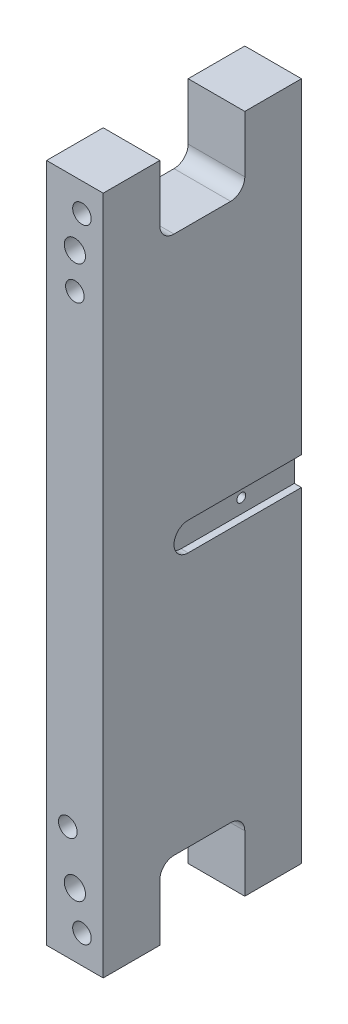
ISO-10303-21;
HEADER;
FILE_DESCRIPTION(('STEP AP214'),'2;1');
FILE_NAME('part.step','',(''),(''),'','','');
FILE_SCHEMA(('AUTOMOTIVE_DESIGN { 1 0 10303 214 1 1 1 1 }'));
ENDSEC;
DATA;
#1=APPLICATION_CONTEXT('core data for automotive mechanical design processes');
#2=APPLICATION_PROTOCOL_DEFINITION('international standard','automotive_design',2000,#1);
#3=PRODUCT_CONTEXT('',#1,'mechanical');
#4=PRODUCT('Part','Part','',(#3));
#5=PRODUCT_RELATED_PRODUCT_CATEGORY('part','',(#4));
#6=PRODUCT_DEFINITION_FORMATION('','',#4);
#7=PRODUCT_DEFINITION_CONTEXT('part definition',#1,'design');
#8=PRODUCT_DEFINITION('design','',#6,#7);
#9=PRODUCT_DEFINITION_SHAPE('','',#8);
#10=(LENGTH_UNIT() NAMED_UNIT(*) SI_UNIT(.MILLI.,.METRE.));
#11=(NAMED_UNIT(*) PLANE_ANGLE_UNIT() SI_UNIT($,.RADIAN.));
#12=(NAMED_UNIT(*) SI_UNIT($,.STERADIAN.) SOLID_ANGLE_UNIT());
#13=UNCERTAINTY_MEASURE_WITH_UNIT(LENGTH_MEASURE(1.E-05),#10,'distance_accuracy_value','');
#14=(GEOMETRIC_REPRESENTATION_CONTEXT(3) GLOBAL_UNCERTAINTY_ASSIGNED_CONTEXT((#13)) GLOBAL_UNIT_ASSIGNED_CONTEXT((#10,
#11,#12)) REPRESENTATION_CONTEXT('',''));
#15=CARTESIAN_POINT('',(0.,0.,0.));
#16=DIRECTION('',(0.,0.,1.));
#17=DIRECTION('',(1.,0.,0.));
#18=AXIS2_PLACEMENT_3D('',#15,#16,#17);
#19=CARTESIAN_POINT('',(160.643705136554,-304.8,0.));
#20=DIRECTION('',(0.,1.,0.));
#21=DIRECTION('',(-1.,0.,0.));
#22=AXIS2_PLACEMENT_3D('',#19,#20,#21);
#23=PLANE('',#22);
#24=DIRECTION('',(-1.,0.,0.));
#25=VECTOR('',#24,1.);
#26=CARTESIAN_POINT('',(160.643705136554,-304.8,0.));
#27=LINE('',#26,#25);
#28=CARTESIAN_POINT('',(0.,-304.8,0.));
#29=VERTEX_POINT('',#28);
#30=CARTESIAN_POINT('',(-50.8,-304.8,0.));
#31=VERTEX_POINT('',#30);
#32=EDGE_CURVE('E293',#29,#31,#27,.T.);
#33=ORIENTED_EDGE('',*,*,#32,.F.);
#34=DIRECTION('',(0.,0.,1.));
#35=VECTOR('',#34,1.);
#36=CARTESIAN_POINT('',(0.,-304.8,0.));
#37=LINE('',#36,#35);
#38=CARTESIAN_POINT('',(0.,-304.8,50.8));
#39=VERTEX_POINT('',#38);
#40=EDGE_CURVE('E280',#29,#39,#37,.T.);
#41=ORIENTED_EDGE('',*,*,#40,.T.);
#42=DIRECTION('',(-1.,0.,0.));
#43=VECTOR('',#42,1.);
#44=CARTESIAN_POINT('',(160.643705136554,-304.8,50.8));
#45=LINE('',#44,#43);
#46=CARTESIAN_POINT('',(-50.8,-304.8,50.8));
#47=VERTEX_POINT('',#46);
#48=EDGE_CURVE('E296',#39,#47,#45,.T.);
#49=ORIENTED_EDGE('',*,*,#48,.T.);
#50=DIRECTION('',(0.,0.,1.));
#51=VECTOR('',#50,1.);
#52=CARTESIAN_POINT('',(-50.8,-304.8,0.));
#53=LINE('',#52,#51);
#54=EDGE_CURVE('E404',#31,#47,#53,.T.);
#55=ORIENTED_EDGE('',*,*,#54,.F.);
#56=EDGE_LOOP('',(#33,#41,#49,#55));
#57=FACE_BOUND('',#56,.T.);
#58=ADVANCED_FACE('F56',(#57),#23,.F.);
#59=CARTESIAN_POINT('',(160.643705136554,-152.4,50.8));
#60=DIRECTION('',(0.,0.,-1.));
#61=DIRECTION('',(0.,1.,0.));
#62=AXIS2_PLACEMENT_3D('',#59,#60,#61);
#63=PLANE('',#62);
#64=DIRECTION('',(0.,1.,0.));
#65=VECTOR('',#64,1.);
#66=CARTESIAN_POINT('',(0.,-152.4,50.8));
#67=LINE('',#66,#65);
#68=CARTESIAN_POINT('',(0.,-254.,50.8));
#69=VERTEX_POINT('',#68);
#70=EDGE_CURVE('E283',#39,#69,#67,.T.);
#71=ORIENTED_EDGE('',*,*,#70,.T.);
#72=DIRECTION('',(-1.,0.,0.));
#73=VECTOR('',#72,1.);
#74=CARTESIAN_POINT('',(-50.8,-254.,50.8));
#75=LINE('',#74,#73);
#76=CARTESIAN_POINT('',(-50.8,-254.,50.8));
#77=VERTEX_POINT('',#76);
#78=EDGE_CURVE('E288',#69,#77,#75,.T.);
#79=ORIENTED_EDGE('',*,*,#78,.T.);
#80=DIRECTION('',(0.,1.,0.));
#81=VECTOR('',#80,1.);
#82=CARTESIAN_POINT('',(-50.8,-152.4,50.8));
#83=LINE('',#82,#81);
#84=EDGE_CURVE('E400',#47,#77,#83,.T.);
#85=ORIENTED_EDGE('',*,*,#84,.F.);
#86=ORIENTED_EDGE('',*,*,#48,.F.);
#87=EDGE_LOOP('',(#71,#79,#85,#86));
#88=FACE_BOUND('',#87,.T.);
#89=ADVANCED_FACE('F420',(#88),#63,.F.);
#90=CARTESIAN_POINT('',(160.643705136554,-152.4,0.));
#91=DIRECTION('',(0.,0.,1.));
#92=DIRECTION('',(0.,-1.,0.));
#93=AXIS2_PLACEMENT_3D('',#90,#91,#92);
#94=PLANE('',#93);
#95=DIRECTION('',(0.,1.,0.));
#96=VECTOR('',#95,1.);
#97=CARTESIAN_POINT('',(-6.34999999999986,-152.4,0.));
#98=LINE('',#97,#96);
#99=CARTESIAN_POINT('',(-6.35000000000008,-12.7,0.));
#100=VERTEX_POINT('',#99);
#101=CARTESIAN_POINT('',(-6.35000000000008,12.7,0.));
#102=VERTEX_POINT('',#101);
#103=EDGE_CURVE('E12',#100,#102,#98,.T.);
#104=ORIENTED_EDGE('',*,*,#103,.F.);
#105=DIRECTION('',(1.,0.,0.));
#106=VECTOR('',#105,1.);
#107=CARTESIAN_POINT('',(-6.35000000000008,-12.7,0.));
#108=LINE('',#107,#106);
#109=CARTESIAN_POINT('',(0.,-12.7,0.));
#110=VERTEX_POINT('',#109);
#111=EDGE_CURVE('E243',#100,#110,#108,.T.);
#112=ORIENTED_EDGE('',*,*,#111,.T.);
#113=DIRECTION('',(0.,-1.,0.));
#114=VECTOR('',#113,1.);
#115=CARTESIAN_POINT('',(0.,-152.4,0.));
#116=LINE('',#115,#114);
#117=EDGE_CURVE('E278',#110,#29,#116,.T.);
#118=ORIENTED_EDGE('',*,*,#117,.T.);
#119=ORIENTED_EDGE('',*,*,#32,.T.);
#120=DIRECTION('',(0.,-1.,0.));
#121=VECTOR('',#120,1.);
#122=CARTESIAN_POINT('',(-50.8,-152.4,0.));
#123=LINE('',#122,#121);
#124=CARTESIAN_POINT('',(-50.8,304.8,0.));
#125=VERTEX_POINT('',#124);
#126=EDGE_CURVE('E297',#125,#31,#123,.T.);
#127=ORIENTED_EDGE('',*,*,#126,.F.);
#128=DIRECTION('',(-1.,0.,0.));
#129=VECTOR('',#128,1.);
#130=CARTESIAN_POINT('',(160.643705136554,304.8,0.));
#131=LINE('',#130,#129);
#132=CARTESIAN_POINT('',(0.,304.8,0.));
#133=VERTEX_POINT('',#132);
#134=EDGE_CURVE('E473',#133,#125,#131,.T.);
#135=ORIENTED_EDGE('',*,*,#134,.F.);
#136=CARTESIAN_POINT('',(0.,12.7,0.));
#137=VERTEX_POINT('',#136);
#138=EDGE_CURVE('E225',#133,#137,#116,.T.);
#139=ORIENTED_EDGE('',*,*,#138,.T.);
#140=DIRECTION('',(1.,0.,0.));
#141=VECTOR('',#140,1.);
#142=CARTESIAN_POINT('',(-6.35000000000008,12.7,0.));
#143=LINE('',#142,#141);
#144=EDGE_CURVE('E72',#102,#137,#143,.T.);
#145=ORIENTED_EDGE('',*,*,#144,.F.);
#146=EDGE_LOOP('',(#104,#112,#118,#119,#127,#135,#139,#145));
#147=FACE_BOUND('',#146,.T.);
#148=ADVANCED_FACE('F223',(#147),#94,.F.);
#149=CARTESIAN_POINT('',(0.,304.8,177.8));
#150=DIRECTION('',(-1.,0.,0.));
#151=DIRECTION('',(0.,-1.,0.));
#152=AXIS2_PLACEMENT_3D('',#149,#150,#151);
#153=PLANE('',#152);
#154=ORIENTED_EDGE('',*,*,#117,.F.);
#155=DIRECTION('',(0.,0.,-1.));
#156=VECTOR('',#155,1.);
#157=CARTESIAN_POINT('',(0.,-12.7,0.));
#158=LINE('',#157,#156);
#159=CARTESIAN_POINT('',(0.,-12.7,101.6));
#160=VERTEX_POINT('',#159);
#161=EDGE_CURVE('E220',#160,#110,#158,.T.);
#162=ORIENTED_EDGE('',*,*,#161,.F.);
#163=CARTESIAN_POINT('',(0.,0.,101.6));
#164=DIRECTION('',(1.,0.,0.));
#165=DIRECTION('',(0.,1.,0.));
#166=AXIS2_PLACEMENT_3D('',#163,#164,#165);
#167=CIRCLE('',#166,12.7);
#168=CARTESIAN_POINT('',(0.,12.7,101.6));
#169=VERTEX_POINT('',#168);
#170=EDGE_CURVE('E255',#169,#160,#167,.T.);
#171=ORIENTED_EDGE('',*,*,#170,.F.);
#172=DIRECTION('',(0.,0.,1.));
#173=VECTOR('',#172,1.);
#174=CARTESIAN_POINT('',(0.,12.7,0.));
#175=LINE('',#174,#173);
#176=EDGE_CURVE('E261',#137,#169,#175,.T.);
#177=ORIENTED_EDGE('',*,*,#176,.F.);
#178=ORIENTED_EDGE('',*,*,#138,.F.);
#179=DIRECTION('',(0.,0.,1.));
#180=VECTOR('',#179,1.);
#181=CARTESIAN_POINT('',(0.,304.8,0.));
#182=LINE('',#181,#180);
#183=CARTESIAN_POINT('',(0.,304.8,50.8));
#184=VERTEX_POINT('',#183);
#185=EDGE_CURVE('E479',#133,#184,#182,.T.);
#186=ORIENTED_EDGE('',*,*,#185,.T.);
#187=DIRECTION('',(0.,-1.,0.));
#188=VECTOR('',#187,1.);
#189=CARTESIAN_POINT('',(0.,152.4,50.8));
#190=LINE('',#189,#188);
#191=CARTESIAN_POINT('',(0.,254.,50.8));
#192=VERTEX_POINT('',#191);
#193=EDGE_CURVE('E474',#184,#192,#190,.T.);
#194=ORIENTED_EDGE('',*,*,#193,.T.);
#195=CARTESIAN_POINT('',(0.,254.,63.5));
#196=DIRECTION('',(-1.,0.,0.));
#197=DIRECTION('',(0.,-1.,0.));
#198=AXIS2_PLACEMENT_3D('',#195,#196,#197);
#199=CIRCLE('',#198,12.7);
#200=CARTESIAN_POINT('',(4.44089209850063E-13,241.3,63.5));
#201=VERTEX_POINT('',#200);
#202=EDGE_CURVE('E65',#192,#201,#199,.T.);
#203=ORIENTED_EDGE('',*,*,#202,.T.);
#204=DIRECTION('',(0.,0.,-1.));
#205=VECTOR('',#204,1.);
#206=CARTESIAN_POINT('',(4.44089209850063E-13,241.3,50.8));
#207=LINE('',#206,#205);
#208=CARTESIAN_POINT('',(4.44089209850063E-13,241.3,114.3));
#209=VERTEX_POINT('',#208);
#210=EDGE_CURVE('E489',#209,#201,#207,.T.);
#211=ORIENTED_EDGE('',*,*,#210,.F.);
#212=CARTESIAN_POINT('',(4.44089209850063E-13,254.,114.3));
#213=DIRECTION('',(1.,0.,0.));
#214=DIRECTION('',(0.,-1.,0.));
#215=AXIS2_PLACEMENT_3D('',#212,#213,#214);
#216=CIRCLE('',#215,12.7);
#217=CARTESIAN_POINT('',(4.44089209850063E-13,254.,127.));
#218=VERTEX_POINT('',#217);
#219=EDGE_CURVE('E491',#218,#209,#216,.T.);
#220=ORIENTED_EDGE('',*,*,#219,.F.);
#221=DIRECTION('',(0.,-1.,0.));
#222=VECTOR('',#221,1.);
#223=CARTESIAN_POINT('',(4.44089209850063E-13,304.8,127.));
#224=LINE('',#223,#222);
#225=CARTESIAN_POINT('',(4.44089209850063E-13,304.8,127.));
#226=VERTEX_POINT('',#225);
#227=EDGE_CURVE('E338',#226,#218,#224,.T.);
#228=ORIENTED_EDGE('',*,*,#227,.F.);
#229=DIRECTION('',(0.,0.,-1.));
#230=VECTOR('',#229,1.);
#231=CARTESIAN_POINT('',(0.,304.8,177.8));
#232=LINE('',#231,#230);
#233=CARTESIAN_POINT('',(0.,304.8,177.8));
#234=VERTEX_POINT('',#233);
#235=EDGE_CURVE('E396',#234,#226,#232,.T.);
#236=ORIENTED_EDGE('',*,*,#235,.F.);
#237=DIRECTION('',(0.,1.,0.));
#238=VECTOR('',#237,1.);
#239=CARTESIAN_POINT('',(0.,304.8,177.8));
#240=LINE('',#239,#238);
#241=CARTESIAN_POINT('',(0.,-304.8,177.8));
#242=VERTEX_POINT('',#241);
#243=EDGE_CURVE('E371',#242,#234,#240,.T.);
#244=ORIENTED_EDGE('',*,*,#243,.F.);
#245=DIRECTION('',(0.,0.,-1.));
#246=VECTOR('',#245,1.);
#247=CARTESIAN_POINT('',(0.,-304.8,177.8));
#248=LINE('',#247,#246);
#249=CARTESIAN_POINT('',(2.22044604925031E-13,-304.8,127.));
#250=VERTEX_POINT('',#249);
#251=EDGE_CURVE('E384',#242,#250,#248,.T.);
#252=ORIENTED_EDGE('',*,*,#251,.T.);
#253=DIRECTION('',(0.,1.,0.));
#254=VECTOR('',#253,1.);
#255=CARTESIAN_POINT('',(2.22044604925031E-13,-304.8,127.));
#256=LINE('',#255,#254);
#257=CARTESIAN_POINT('',(2.22044604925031E-13,-254.,127.));
#258=VERTEX_POINT('',#257);
#259=EDGE_CURVE('E341',#250,#258,#256,.T.);
#260=ORIENTED_EDGE('',*,*,#259,.T.);
#261=CARTESIAN_POINT('',(2.22044604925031E-13,-254.,114.3));
#262=DIRECTION('',(-1.,0.,0.));
#263=DIRECTION('',(0.,1.,0.));
#264=AXIS2_PLACEMENT_3D('',#261,#262,#263);
#265=CIRCLE('',#264,12.7);
#266=CARTESIAN_POINT('',(2.22044604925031E-13,-241.3,114.3));
#267=VERTEX_POINT('',#266);
#268=EDGE_CURVE('E345',#258,#267,#265,.T.);
#269=ORIENTED_EDGE('',*,*,#268,.T.);
#270=DIRECTION('',(0.,0.,-1.));
#271=VECTOR('',#270,1.);
#272=CARTESIAN_POINT('',(2.22044604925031E-13,-241.3,50.8));
#273=LINE('',#272,#271);
#274=CARTESIAN_POINT('',(2.22044604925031E-13,-241.3,63.5));
#275=VERTEX_POINT('',#274);
#276=EDGE_CURVE('E351',#267,#275,#273,.T.);
#277=ORIENTED_EDGE('',*,*,#276,.T.);
#278=CARTESIAN_POINT('',(0.,-254.,63.5));
#279=DIRECTION('',(-1.,0.,0.));
#280=DIRECTION('',(0.,-1.,0.));
#281=AXIS2_PLACEMENT_3D('',#278,#279,#280);
#282=CIRCLE('',#281,12.7);
#283=EDGE_CURVE('E321',#275,#69,#282,.T.);
#284=ORIENTED_EDGE('',*,*,#283,.T.);
#285=ORIENTED_EDGE('',*,*,#70,.F.);
#286=ORIENTED_EDGE('',*,*,#40,.F.);
#287=EDGE_LOOP('',(#154,#162,#171,#177,#178,#186,#194,#203,#211,#220,#228,#236,#244,#252,#260,
#269,#277,#284,#285,#286));
#288=FACE_BOUND('',#287,.T.);
#289=ADVANCED_FACE('F276',(#288),#153,.F.);
#290=CARTESIAN_POINT('',(-50.8,304.8,177.8));
#291=DIRECTION('',(1.,0.,0.));
#292=DIRECTION('',(0.,1.,0.));
#293=AXIS2_PLACEMENT_3D('',#290,#291,#292);
#294=PLANE('',#293);
#295=CARTESIAN_POINT('',(-50.8,0.,47.625));
#296=DIRECTION('',(1.,0.,0.));
#297=DIRECTION('',(0.,0.,-1.));
#298=AXIS2_PLACEMENT_3D('',#295,#296,#297);
#299=CIRCLE('',#298,3.96874999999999);
#300=CARTESIAN_POINT('',(-50.8,0.,43.65625));
#301=VERTEX_POINT('',#300);
#302=EDGE_CURVE('E633',#301,#301,#299,.T.);
#303=ORIENTED_EDGE('',*,*,#302,.T.);
#304=EDGE_LOOP('',(#303));
#305=FACE_BOUND('',#304,.T.);
#306=ORIENTED_EDGE('',*,*,#84,.T.);
#307=CARTESIAN_POINT('',(-50.8,-254.,63.5));
#308=DIRECTION('',(1.,0.,0.));
#309=DIRECTION('',(0.,1.,0.));
#310=AXIS2_PLACEMENT_3D('',#307,#308,#309);
#311=CIRCLE('',#310,12.7);
#312=CARTESIAN_POINT('',(-50.8,-241.3,63.5));
#313=VERTEX_POINT('',#312);
#314=EDGE_CURVE('E324',#77,#313,#311,.T.);
#315=ORIENTED_EDGE('',*,*,#314,.T.);
#316=DIRECTION('',(0.,0.,-1.));
#317=VECTOR('',#316,1.);
#318=CARTESIAN_POINT('',(-50.8,-241.3,50.8));
#319=LINE('',#318,#317);
#320=CARTESIAN_POINT('',(-50.8,-241.3,114.3));
#321=VERTEX_POINT('',#320);
#322=EDGE_CURVE('E346',#321,#313,#319,.T.);
#323=ORIENTED_EDGE('',*,*,#322,.F.);
#324=CARTESIAN_POINT('',(-50.8,-254.,114.3));
#325=DIRECTION('',(-1.,0.,0.));
#326=DIRECTION('',(0.,1.,0.));
#327=AXIS2_PLACEMENT_3D('',#324,#325,#326);
#328=CIRCLE('',#327,12.7);
#329=CARTESIAN_POINT('',(-50.8,-254.,127.));
#330=VERTEX_POINT('',#329);
#331=EDGE_CURVE('E435',#330,#321,#328,.T.);
#332=ORIENTED_EDGE('',*,*,#331,.F.);
#333=DIRECTION('',(0.,1.,0.));
#334=VECTOR('',#333,1.);
#335=CARTESIAN_POINT('',(-50.8,-304.8,127.));
#336=LINE('',#335,#334);
#337=CARTESIAN_POINT('',(-50.8,-304.8,127.));
#338=VERTEX_POINT('',#337);
#339=EDGE_CURVE('E509',#338,#330,#336,.T.);
#340=ORIENTED_EDGE('',*,*,#339,.F.);
#341=DIRECTION('',(0.,0.,-1.));
#342=VECTOR('',#341,1.);
#343=CARTESIAN_POINT('',(-50.8,-304.8,177.8));
#344=LINE('',#343,#342);
#345=CARTESIAN_POINT('',(-50.8,-304.8,177.8));
#346=VERTEX_POINT('',#345);
#347=EDGE_CURVE('E388',#346,#338,#344,.T.);
#348=ORIENTED_EDGE('',*,*,#347,.F.);
#349=DIRECTION('',(0.,-1.,0.));
#350=VECTOR('',#349,1.);
#351=CARTESIAN_POINT('',(-50.8,304.8,177.8));
#352=LINE('',#351,#350);
#353=CARTESIAN_POINT('',(-50.8,304.8,177.8));
#354=VERTEX_POINT('',#353);
#355=EDGE_CURVE('E378',#354,#346,#352,.T.);
#356=ORIENTED_EDGE('',*,*,#355,.F.);
#357=DIRECTION('',(0.,0.,-1.));
#358=VECTOR('',#357,1.);
#359=CARTESIAN_POINT('',(-50.8,304.8,177.8));
#360=LINE('',#359,#358);
#361=CARTESIAN_POINT('',(-50.8,304.8,127.));
#362=VERTEX_POINT('',#361);
#363=EDGE_CURVE('E392',#354,#362,#360,.T.);
#364=ORIENTED_EDGE('',*,*,#363,.T.);
#365=DIRECTION('',(0.,-1.,0.));
#366=VECTOR('',#365,1.);
#367=CARTESIAN_POINT('',(-50.8,304.8,127.));
#368=LINE('',#367,#366);
#369=CARTESIAN_POINT('',(-50.8,254.,127.));
#370=VERTEX_POINT('',#369);
#371=EDGE_CURVE('E492',#362,#370,#368,.T.);
#372=ORIENTED_EDGE('',*,*,#371,.T.);
#373=CARTESIAN_POINT('',(-50.8,254.,114.3));
#374=DIRECTION('',(1.,0.,0.));
#375=DIRECTION('',(0.,-1.,0.));
#376=AXIS2_PLACEMENT_3D('',#373,#374,#375);
#377=CIRCLE('',#376,12.7);
#378=CARTESIAN_POINT('',(-50.8,241.3,114.3));
#379=VERTEX_POINT('',#378);
#380=EDGE_CURVE('E499',#370,#379,#377,.T.);
#381=ORIENTED_EDGE('',*,*,#380,.T.);
#382=DIRECTION('',(0.,0.,-1.));
#383=VECTOR('',#382,1.);
#384=CARTESIAN_POINT('',(-50.8,241.3,50.8));
#385=LINE('',#384,#383);
#386=CARTESIAN_POINT('',(-50.8,241.3,63.5));
#387=VERTEX_POINT('',#386);
#388=EDGE_CURVE('E478',#379,#387,#385,.T.);
#389=ORIENTED_EDGE('',*,*,#388,.T.);
#390=CARTESIAN_POINT('',(-50.8,254.,63.5));
#391=DIRECTION('',(1.,0.,0.));
#392=DIRECTION('',(0.,1.,0.));
#393=AXIS2_PLACEMENT_3D('',#390,#391,#392);
#394=CIRCLE('',#393,12.7);
#395=CARTESIAN_POINT('',(-50.8,254.,50.8));
#396=VERTEX_POINT('',#395);
#397=EDGE_CURVE('E80',#387,#396,#394,.T.);
#398=ORIENTED_EDGE('',*,*,#397,.T.);
#399=DIRECTION('',(0.,-1.,0.));
#400=VECTOR('',#399,1.);
#401=CARTESIAN_POINT('',(-50.8,152.4,50.8));
#402=LINE('',#401,#400);
#403=CARTESIAN_POINT('',(-50.8,304.8,50.8));
#404=VERTEX_POINT('',#403);
#405=EDGE_CURVE('E468',#404,#396,#402,.T.);
#406=ORIENTED_EDGE('',*,*,#405,.F.);
#407=DIRECTION('',(0.,0.,1.));
#408=VECTOR('',#407,1.);
#409=CARTESIAN_POINT('',(-50.8,304.8,0.));
#410=LINE('',#409,#408);
#411=EDGE_CURVE('E415',#125,#404,#410,.T.);
#412=ORIENTED_EDGE('',*,*,#411,.F.);
#413=ORIENTED_EDGE('',*,*,#126,.T.);
#414=ORIENTED_EDGE('',*,*,#54,.T.);
#415=EDGE_LOOP('',(#306,#315,#323,#332,#340,#348,#356,#364,#372,#381,#389,#398,#406,#412,#413,#414));
#416=FACE_BOUND('',#415,.T.);
#417=ADVANCED_FACE('F412',(#305,#416),#294,.F.);
#418=CARTESIAN_POINT('',(0.,304.8,177.8));
#419=DIRECTION('',(0.,-1.,0.));
#420=DIRECTION('',(0.,0.,-1.));
#421=AXIS2_PLACEMENT_3D('',#418,#419,#420);
#422=PLANE('',#421);
#423=DIRECTION('',(-1.,0.,0.));
#424=VECTOR('',#423,1.);
#425=CARTESIAN_POINT('',(4.44089209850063E-13,304.8,127.));
#426=LINE('',#425,#424);
#427=EDGE_CURVE('E506',#226,#362,#426,.T.);
#428=ORIENTED_EDGE('',*,*,#427,.T.);
#429=ORIENTED_EDGE('',*,*,#363,.F.);
#430=DIRECTION('',(-1.,0.,0.));
#431=VECTOR('',#430,1.);
#432=CARTESIAN_POINT('',(0.,304.8,177.8));
#433=LINE('',#432,#431);
#434=EDGE_CURVE('E375',#234,#354,#433,.T.);
#435=ORIENTED_EDGE('',*,*,#434,.F.);
#436=ORIENTED_EDGE('',*,*,#235,.T.);
#437=EDGE_LOOP('',(#428,#429,#435,#436));
#438=FACE_BOUND('',#437,.T.);
#439=ADVANCED_FACE('F528',(#438),#422,.F.);
#440=CARTESIAN_POINT('',(0.,-304.8,177.8));
#441=DIRECTION('',(0.,1.,0.));
#442=DIRECTION('',(0.,0.,1.));
#443=AXIS2_PLACEMENT_3D('',#440,#441,#442);
#444=PLANE('',#443);
#445=ORIENTED_EDGE('',*,*,#347,.T.);
#446=DIRECTION('',(-1.,0.,0.));
#447=VECTOR('',#446,1.);
#448=CARTESIAN_POINT('',(2.22044604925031E-13,-304.8,127.));
#449=LINE('',#448,#447);
#450=EDGE_CURVE('E366',#250,#338,#449,.T.);
#451=ORIENTED_EDGE('',*,*,#450,.F.);
#452=ORIENTED_EDGE('',*,*,#251,.F.);
#453=DIRECTION('',(1.,0.,0.));
#454=VECTOR('',#453,1.);
#455=CARTESIAN_POINT('',(0.,-304.8,177.8));
#456=LINE('',#455,#454);
#457=EDGE_CURVE('E381',#346,#242,#456,.T.);
#458=ORIENTED_EDGE('',*,*,#457,.F.);
#459=EDGE_LOOP('',(#445,#451,#452,#458));
#460=FACE_BOUND('',#459,.T.);
#461=ADVANCED_FACE('F661',(#460),#444,.F.);
#462=CARTESIAN_POINT('',(0.,0.,177.8));
#463=DIRECTION('',(0.,0.,-1.));
#464=DIRECTION('',(-1.,0.,0.));
#465=AXIS2_PLACEMENT_3D('',#462,#463,#464);
#466=PLANE('',#465);
#467=CARTESIAN_POINT('',(-25.3999999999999,247.65,177.8));
#468=DIRECTION('',(0.,0.,1.));
#469=DIRECTION('',(1.,0.,0.));
#470=AXIS2_PLACEMENT_3D('',#467,#468,#469);
#471=CIRCLE('',#470,9.525);
#472=CARTESIAN_POINT('',(-15.8749999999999,247.65,177.8));
#473=VERTEX_POINT('',#472);
#474=EDGE_CURVE('E242',#473,#473,#471,.T.);
#475=ORIENTED_EDGE('',*,*,#474,.F.);
#476=EDGE_LOOP('',(#475));
#477=FACE_BOUND('',#476,.T.);
#478=CARTESIAN_POINT('',(-25.4000000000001,-247.65,177.8));
#479=DIRECTION('',(0.,0.,1.));
#480=DIRECTION('',(1.,0.,0.));
#481=AXIS2_PLACEMENT_3D('',#478,#479,#480);
#482=CIRCLE('',#481,9.525);
#483=CARTESIAN_POINT('',(-15.8750000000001,-247.65,177.8));
#484=VERTEX_POINT('',#483);
#485=EDGE_CURVE('E724',#484,#484,#482,.T.);
#486=ORIENTED_EDGE('',*,*,#485,.F.);
#487=EDGE_LOOP('',(#486));
#488=FACE_BOUND('',#487,.T.);
#489=CARTESIAN_POINT('',(-19.05,-279.4,177.8));
#490=DIRECTION('',(0.,0.,1.));
#491=DIRECTION('',(1.,0.,0.));
#492=AXIS2_PLACEMENT_3D('',#489,#490,#491);
#493=CIRCLE('',#492,8.33374);
#494=CARTESIAN_POINT('',(-10.71626,-279.4,177.8));
#495=VERTEX_POINT('',#494);
#496=EDGE_CURVE('E717',#495,#495,#493,.T.);
#497=ORIENTED_EDGE('',*,*,#496,.F.);
#498=EDGE_LOOP('',(#497));
#499=FACE_BOUND('',#498,.T.);
#500=CARTESIAN_POINT('',(-31.7499999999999,-203.2,177.8));
#501=DIRECTION('',(0.,0.,1.));
#502=DIRECTION('',(1.,0.,0.));
#503=AXIS2_PLACEMENT_3D('',#500,#501,#502);
#504=CIRCLE('',#503,8.33374);
#505=CARTESIAN_POINT('',(-23.4162599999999,-203.2,177.8));
#506=VERTEX_POINT('',#505);
#507=EDGE_CURVE('E693',#506,#506,#504,.T.);
#508=ORIENTED_EDGE('',*,*,#507,.F.);
#509=EDGE_LOOP('',(#508));
#510=FACE_BOUND('',#509,.T.);
#511=CARTESIAN_POINT('',(-19.05,279.4,177.8));
#512=DIRECTION('',(0.,0.,1.));
#513=DIRECTION('',(1.,0.,0.));
#514=AXIS2_PLACEMENT_3D('',#511,#512,#513);
#515=CIRCLE('',#514,8.33374);
#516=CARTESIAN_POINT('',(-10.71626,279.4,177.8));
#517=VERTEX_POINT('',#516);
#518=EDGE_CURVE('E689',#517,#517,#515,.T.);
#519=ORIENTED_EDGE('',*,*,#518,.F.);
#520=EDGE_LOOP('',(#519));
#521=FACE_BOUND('',#520,.T.);
#522=CARTESIAN_POINT('',(-25.4000000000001,215.9,177.8));
#523=DIRECTION('',(0.,0.,1.));
#524=DIRECTION('',(1.,0.,0.));
#525=AXIS2_PLACEMENT_3D('',#522,#523,#524);
#526=CIRCLE('',#525,8.33374);
#527=CARTESIAN_POINT('',(-17.0662600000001,215.9,177.8));
#528=VERTEX_POINT('',#527);
#529=EDGE_CURVE('E460',#528,#528,#526,.T.);
#530=ORIENTED_EDGE('',*,*,#529,.F.);
#531=EDGE_LOOP('',(#530));
#532=FACE_BOUND('',#531,.T.);
#533=ORIENTED_EDGE('',*,*,#243,.T.);
#534=ORIENTED_EDGE('',*,*,#434,.T.);
#535=ORIENTED_EDGE('',*,*,#355,.T.);
#536=ORIENTED_EDGE('',*,*,#457,.T.);
#537=EDGE_LOOP('',(#533,#534,#535,#536));
#538=FACE_BOUND('',#537,.T.);
#539=ADVANCED_FACE('F532',(#477,#488,#499,#510,#521,#532,#538),#466,.F.);
#540=CARTESIAN_POINT('',(2.22044604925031E-13,-241.3,50.8));
#541=DIRECTION('',(0.,1.,0.));
#542=DIRECTION('',(-1.,0.,0.));
#543=AXIS2_PLACEMENT_3D('',#540,#541,#542);
#544=PLANE('',#543);
#545=ORIENTED_EDGE('',*,*,#322,.T.);
#546=DIRECTION('',(-1.,0.,0.));
#547=VECTOR('',#546,1.);
#548=CARTESIAN_POINT('',(2.22044604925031E-13,-241.3,63.5));
#549=LINE('',#548,#547);
#550=EDGE_CURVE('E306',#313,#275,#549,.F.);
#551=ORIENTED_EDGE('',*,*,#550,.T.);
#552=ORIENTED_EDGE('',*,*,#276,.F.);
#553=DIRECTION('',(-1.,0.,0.));
#554=VECTOR('',#553,1.);
#555=CARTESIAN_POINT('',(2.22044604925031E-13,-241.3,114.3));
#556=LINE('',#555,#554);
#557=EDGE_CURVE('E365',#267,#321,#556,.T.);
#558=ORIENTED_EDGE('',*,*,#557,.T.);
#559=EDGE_LOOP('',(#545,#551,#552,#558));
#560=FACE_BOUND('',#559,.T.);
#561=ADVANCED_FACE('F430',(#560),#544,.F.);
#562=CARTESIAN_POINT('',(2.22044604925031E-13,-254.,114.3));
#563=DIRECTION('',(-1.,0.,0.));
#564=DIRECTION('',(0.,-1.,0.));
#565=AXIS2_PLACEMENT_3D('',#562,#563,#564);
#566=CYLINDRICAL_SURFACE('',#565,12.7);
#567=ORIENTED_EDGE('',*,*,#331,.T.);
#568=ORIENTED_EDGE('',*,*,#557,.F.);
#569=ORIENTED_EDGE('',*,*,#268,.F.);
#570=DIRECTION('',(-1.,0.,0.));
#571=VECTOR('',#570,1.);
#572=CARTESIAN_POINT('',(2.22044604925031E-13,-254.,127.));
#573=LINE('',#572,#571);
#574=EDGE_CURVE('E361',#258,#330,#573,.T.);
#575=ORIENTED_EDGE('',*,*,#574,.T.);
#576=EDGE_LOOP('',(#567,#568,#569,#575));
#577=FACE_BOUND('',#576,.T.);
#578=ADVANCED_FACE('F673',(#577),#566,.F.);
#579=CARTESIAN_POINT('',(2.22044604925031E-13,-304.8,127.));
#580=DIRECTION('',(0.,0.,1.));
#581=DIRECTION('',(1.,0.,0.));
#582=AXIS2_PLACEMENT_3D('',#579,#580,#581);
#583=PLANE('',#582);
#584=CARTESIAN_POINT('',(-19.05,-279.4,127.));
#585=DIRECTION('',(0.,0.,1.));
#586=DIRECTION('',(1.,0.,0.));
#587=AXIS2_PLACEMENT_3D('',#584,#585,#586);
#588=CIRCLE('',#587,8.33374);
#589=CARTESIAN_POINT('',(-10.71626,-279.4,127.));
#590=VERTEX_POINT('',#589);
#591=EDGE_CURVE('E712',#590,#590,#588,.T.);
#592=ORIENTED_EDGE('',*,*,#591,.T.);
#593=EDGE_LOOP('',(#592));
#594=FACE_BOUND('',#593,.T.);
#595=ORIENTED_EDGE('',*,*,#339,.T.);
#596=ORIENTED_EDGE('',*,*,#574,.F.);
#597=ORIENTED_EDGE('',*,*,#259,.F.);
#598=ORIENTED_EDGE('',*,*,#450,.T.);
#599=EDGE_LOOP('',(#595,#596,#597,#598));
#600=FACE_BOUND('',#599,.T.);
#601=ADVANCED_FACE('F670',(#594,#600),#583,.F.);
#602=CARTESIAN_POINT('',(4.44089209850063E-13,304.8,127.));
#603=DIRECTION('',(0.,0.,-1.));
#604=DIRECTION('',(-1.,0.,0.));
#605=AXIS2_PLACEMENT_3D('',#602,#603,#604);
#606=PLANE('',#605);
#607=CARTESIAN_POINT('',(-19.05,279.4,127.));
#608=DIRECTION('',(0.,0.,-1.));
#609=DIRECTION('',(-1.,0.,0.));
#610=AXIS2_PLACEMENT_3D('',#607,#608,#609);
#611=CIRCLE('',#610,8.33374);
#612=CARTESIAN_POINT('',(-27.38374,279.4,127.));
#613=VERTEX_POINT('',#612);
#614=EDGE_CURVE('E461',#613,#613,#611,.T.);
#615=ORIENTED_EDGE('',*,*,#614,.F.);
#616=EDGE_LOOP('',(#615));
#617=FACE_BOUND('',#616,.T.);
#618=ORIENTED_EDGE('',*,*,#371,.F.);
#619=ORIENTED_EDGE('',*,*,#427,.F.);
#620=ORIENTED_EDGE('',*,*,#227,.T.);
#621=DIRECTION('',(-1.,0.,0.));
#622=VECTOR('',#621,1.);
#623=CARTESIAN_POINT('',(4.44089209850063E-13,254.,127.));
#624=LINE('',#623,#622);
#625=EDGE_CURVE('E337',#218,#370,#624,.T.);
#626=ORIENTED_EDGE('',*,*,#625,.T.);
#627=EDGE_LOOP('',(#618,#619,#620,#626));
#628=FACE_BOUND('',#627,.T.);
#629=ADVANCED_FACE('F520',(#617,#628),#606,.T.);
#630=CARTESIAN_POINT('',(4.44089209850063E-13,254.,114.3));
#631=DIRECTION('',(-1.,0.,0.));
#632=DIRECTION('',(0.,-1.,0.));
#633=AXIS2_PLACEMENT_3D('',#630,#631,#632);
#634=CYLINDRICAL_SURFACE('',#633,12.7);
#635=ORIENTED_EDGE('',*,*,#380,.F.);
#636=ORIENTED_EDGE('',*,*,#625,.F.);
#637=ORIENTED_EDGE('',*,*,#219,.T.);
#638=DIRECTION('',(-1.,0.,0.));
#639=VECTOR('',#638,1.);
#640=CARTESIAN_POINT('',(4.44089209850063E-13,241.3,114.3));
#641=LINE('',#640,#639);
#642=EDGE_CURVE('E332',#209,#379,#641,.T.);
#643=ORIENTED_EDGE('',*,*,#642,.T.);
#644=EDGE_LOOP('',(#635,#636,#637,#643));
#645=FACE_BOUND('',#644,.T.);
#646=ADVANCED_FACE('F524',(#645),#634,.F.);
#647=CARTESIAN_POINT('',(4.44089209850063E-13,241.3,50.8));
#648=DIRECTION('',(0.,1.,0.));
#649=DIRECTION('',(-1.,0.,0.));
#650=AXIS2_PLACEMENT_3D('',#647,#648,#649);
#651=PLANE('',#650);
#652=ORIENTED_EDGE('',*,*,#210,.T.);
#653=DIRECTION('',(-1.,0.,0.));
#654=VECTOR('',#653,1.);
#655=CARTESIAN_POINT('',(4.44089209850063E-13,241.3,63.5));
#656=LINE('',#655,#654);
#657=EDGE_CURVE('E439',#201,#387,#656,.T.);
#658=ORIENTED_EDGE('',*,*,#657,.T.);
#659=ORIENTED_EDGE('',*,*,#388,.F.);
#660=ORIENTED_EDGE('',*,*,#642,.F.);
#661=EDGE_LOOP('',(#652,#658,#659,#660));
#662=FACE_BOUND('',#661,.T.);
#663=ADVANCED_FACE('F536',(#662),#651,.T.);
#664=CARTESIAN_POINT('',(160.643705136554,304.8,0.));
#665=DIRECTION('',(0.,-1.,0.));
#666=DIRECTION('',(-1.,0.,0.));
#667=AXIS2_PLACEMENT_3D('',#664,#665,#666);
#668=PLANE('',#667);
#669=ORIENTED_EDGE('',*,*,#134,.T.);
#670=ORIENTED_EDGE('',*,*,#411,.T.);
#671=DIRECTION('',(-1.,0.,0.));
#672=VECTOR('',#671,1.);
#673=CARTESIAN_POINT('',(160.643705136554,304.8,50.8));
#674=LINE('',#673,#672);
#675=EDGE_CURVE('E482',#184,#404,#674,.T.);
#676=ORIENTED_EDGE('',*,*,#675,.F.);
#677=ORIENTED_EDGE('',*,*,#185,.F.);
#678=EDGE_LOOP('',(#669,#670,#676,#677));
#679=FACE_BOUND('',#678,.T.);
#680=ADVANCED_FACE('F545',(#679),#668,.F.);
#681=CARTESIAN_POINT('',(160.643705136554,152.4,50.8));
#682=DIRECTION('',(0.,0.,-1.));
#683=DIRECTION('',(0.,-1.,0.));
#684=AXIS2_PLACEMENT_3D('',#681,#682,#683);
#685=PLANE('',#684);
#686=ORIENTED_EDGE('',*,*,#405,.T.);
#687=DIRECTION('',(-1.,0.,0.));
#688=VECTOR('',#687,1.);
#689=CARTESIAN_POINT('',(160.643705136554,254.,50.8));
#690=LINE('',#689,#688);
#691=EDGE_CURVE('E428',#396,#192,#690,.F.);
#692=ORIENTED_EDGE('',*,*,#691,.T.);
#693=ORIENTED_EDGE('',*,*,#193,.F.);
#694=ORIENTED_EDGE('',*,*,#675,.T.);
#695=EDGE_LOOP('',(#686,#692,#693,#694));
#696=FACE_BOUND('',#695,.T.);
#697=ADVANCED_FACE('F541',(#696),#685,.F.);
#698=CARTESIAN_POINT('',(160.643705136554,-254.,63.5));
#699=DIRECTION('',(1.,0.,0.));
#700=DIRECTION('',(0.,1.,0.));
#701=AXIS2_PLACEMENT_3D('',#698,#699,#700);
#702=CYLINDRICAL_SURFACE('',#701,12.7);
#703=ORIENTED_EDGE('',*,*,#283,.F.);
#704=ORIENTED_EDGE('',*,*,#550,.F.);
#705=ORIENTED_EDGE('',*,*,#314,.F.);
#706=ORIENTED_EDGE('',*,*,#78,.F.);
#707=EDGE_LOOP('',(#703,#704,#705,#706));
#708=FACE_BOUND('',#707,.T.);
#709=ADVANCED_FACE('F437',(#708),#702,.F.);
#710=CARTESIAN_POINT('',(4.44089209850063E-13,254.,63.5));
#711=DIRECTION('',(-1.,0.,0.));
#712=DIRECTION('',(0.,-1.,0.));
#713=AXIS2_PLACEMENT_3D('',#710,#711,#712);
#714=CYLINDRICAL_SURFACE('',#713,12.7);
#715=ORIENTED_EDGE('',*,*,#202,.F.);
#716=ORIENTED_EDGE('',*,*,#691,.F.);
#717=ORIENTED_EDGE('',*,*,#397,.F.);
#718=ORIENTED_EDGE('',*,*,#657,.F.);
#719=EDGE_LOOP('',(#715,#716,#717,#718));
#720=FACE_BOUND('',#719,.T.);
#721=ADVANCED_FACE('F58',(#720),#714,.F.);
#722=CARTESIAN_POINT('',(-25.4000000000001,215.9,177.8));
#723=DIRECTION('',(0.,0.,1.));
#724=DIRECTION('',(1.,0.,0.));
#725=AXIS2_PLACEMENT_3D('',#722,#723,#724);
#726=CYLINDRICAL_SURFACE('',#725,8.33374);
#727=CARTESIAN_POINT('',(-25.4000000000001,215.9,114.3));
#728=DIRECTION('',(0.,0.,1.));
#729=DIRECTION('',(1.,0.,0.));
#730=AXIS2_PLACEMENT_3D('',#727,#728,#729);
#731=CIRCLE('',#730,8.33373999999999);
#732=CARTESIAN_POINT('',(-17.0662600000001,215.9,114.3));
#733=VERTEX_POINT('',#732);
#734=EDGE_CURVE('E455',#733,#733,#731,.T.);
#735=ORIENTED_EDGE('',*,*,#734,.F.);
#736=EDGE_LOOP('',(#735));
#737=FACE_BOUND('',#736,.T.);
#738=ORIENTED_EDGE('',*,*,#529,.T.);
#739=EDGE_LOOP('',(#738));
#740=FACE_BOUND('',#739,.T.);
#741=ADVANCED_FACE('F569',(#737,#740),#726,.F.);
#742=CARTESIAN_POINT('',(-25.4000000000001,215.9,114.3));
#743=DIRECTION('',(0.,0.,1.));
#744=DIRECTION('',(1.,0.,0.));
#745=AXIS2_PLACEMENT_3D('',#742,#743,#744);
#746=CONICAL_SURFACE('',#745,8.33373999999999,1.02974425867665);
#747=CARTESIAN_POINT('',(-25.4000000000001,215.9,109.292583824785));
#748=VERTEX_POINT('',#747);
#749=VERTEX_LOOP('',#748);
#750=FACE_BOUND('',#749,.T.);
#751=ORIENTED_EDGE('',*,*,#734,.T.);
#752=EDGE_LOOP('',(#751));
#753=FACE_BOUND('',#752,.T.);
#754=ADVANCED_FACE('F574',(#750,#753),#746,.F.);
#755=CARTESIAN_POINT('',(-19.05,279.4,177.8));
#756=DIRECTION('',(0.,0.,1.));
#757=DIRECTION('',(1.,0.,0.));
#758=AXIS2_PLACEMENT_3D('',#755,#756,#757);
#759=CYLINDRICAL_SURFACE('',#758,8.33374);
#760=ORIENTED_EDGE('',*,*,#614,.T.);
#761=EDGE_LOOP('',(#760));
#762=FACE_BOUND('',#761,.T.);
#763=ORIENTED_EDGE('',*,*,#518,.T.);
#764=EDGE_LOOP('',(#763));
#765=FACE_BOUND('',#764,.T.);
#766=ADVANCED_FACE('F580',(#762,#765),#759,.F.);
#767=CARTESIAN_POINT('',(-31.7499999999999,-203.2,177.8));
#768=DIRECTION('',(0.,0.,1.));
#769=DIRECTION('',(1.,0.,0.));
#770=AXIS2_PLACEMENT_3D('',#767,#768,#769);
#771=CYLINDRICAL_SURFACE('',#770,8.33374);
#772=CARTESIAN_POINT('',(-31.7499999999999,-203.2,114.3));
#773=DIRECTION('',(0.,0.,1.));
#774=DIRECTION('',(1.,0.,0.));
#775=AXIS2_PLACEMENT_3D('',#772,#773,#774);
#776=CIRCLE('',#775,8.33373999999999);
#777=CARTESIAN_POINT('',(-23.41626,-203.2,114.3));
#778=VERTEX_POINT('',#777);
#779=EDGE_CURVE('E699',#778,#778,#776,.T.);
#780=ORIENTED_EDGE('',*,*,#779,.F.);
#781=EDGE_LOOP('',(#780));
#782=FACE_BOUND('',#781,.T.);
#783=ORIENTED_EDGE('',*,*,#507,.T.);
#784=EDGE_LOOP('',(#783));
#785=FACE_BOUND('',#784,.T.);
#786=ADVANCED_FACE('F587',(#782,#785),#771,.F.);
#787=CARTESIAN_POINT('',(-31.7499999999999,-203.2,114.3));
#788=DIRECTION('',(0.,0.,1.));
#789=DIRECTION('',(1.,0.,0.));
#790=AXIS2_PLACEMENT_3D('',#787,#788,#789);
#791=CONICAL_SURFACE('',#790,8.33373999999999,1.02974425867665);
#792=CARTESIAN_POINT('',(-31.7499999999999,-203.2,109.292583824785));
#793=VERTEX_POINT('',#792);
#794=VERTEX_LOOP('',#793);
#795=FACE_BOUND('',#794,.T.);
#796=ORIENTED_EDGE('',*,*,#779,.T.);
#797=EDGE_LOOP('',(#796));
#798=FACE_BOUND('',#797,.T.);
#799=ADVANCED_FACE('F591',(#795,#798),#791,.F.);
#800=CARTESIAN_POINT('',(-19.05,-279.4,177.8));
#801=DIRECTION('',(0.,0.,1.));
#802=DIRECTION('',(1.,0.,0.));
#803=AXIS2_PLACEMENT_3D('',#800,#801,#802);
#804=CYLINDRICAL_SURFACE('',#803,8.33374);
#805=ORIENTED_EDGE('',*,*,#496,.T.);
#806=EDGE_LOOP('',(#805));
#807=FACE_BOUND('',#806,.T.);
#808=ORIENTED_EDGE('',*,*,#591,.F.);
#809=EDGE_LOOP('',(#808));
#810=FACE_BOUND('',#809,.T.);
#811=ADVANCED_FACE('F595',(#807,#810),#804,.F.);
#812=CARTESIAN_POINT('',(-25.4000000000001,-247.65,177.8));
#813=DIRECTION('',(0.,0.,1.));
#814=DIRECTION('',(1.,0.,0.));
#815=AXIS2_PLACEMENT_3D('',#812,#813,#814);
#816=CYLINDRICAL_SURFACE('',#815,9.52499999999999);
#817=CARTESIAN_POINT('',(-25.4000000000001,-247.65,133.35));
#818=DIRECTION('',(0.,0.,1.));
#819=DIRECTION('',(1.,0.,0.));
#820=AXIS2_PLACEMENT_3D('',#817,#818,#819);
#821=CIRCLE('',#820,9.52499999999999);
#822=CARTESIAN_POINT('',(-15.8750000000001,-247.65,133.35));
#823=VERTEX_POINT('',#822);
#824=EDGE_CURVE('E720',#823,#823,#821,.T.);
#825=ORIENTED_EDGE('',*,*,#824,.F.);
#826=EDGE_LOOP('',(#825));
#827=FACE_BOUND('',#826,.T.);
#828=ORIENTED_EDGE('',*,*,#485,.T.);
#829=EDGE_LOOP('',(#828));
#830=FACE_BOUND('',#829,.T.);
#831=ADVANCED_FACE('F599',(#827,#830),#816,.F.);
#832=CARTESIAN_POINT('',(-25.4000000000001,-247.65,133.35));
#833=DIRECTION('',(0.,0.,1.));
#834=DIRECTION('',(1.,0.,0.));
#835=AXIS2_PLACEMENT_3D('',#832,#833,#834);
#836=CONICAL_SURFACE('',#835,9.52499999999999,1.02974425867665);
#837=CARTESIAN_POINT('',(-25.4000000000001,-247.65,127.626802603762));
#838=VERTEX_POINT('',#837);
#839=VERTEX_LOOP('',#838);
#840=FACE_BOUND('',#839,.T.);
#841=ORIENTED_EDGE('',*,*,#824,.T.);
#842=EDGE_LOOP('',(#841));
#843=FACE_BOUND('',#842,.T.);
#844=ADVANCED_FACE('F603',(#840,#843),#836,.F.);
#845=CARTESIAN_POINT('',(-25.3999999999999,247.65,177.8));
#846=DIRECTION('',(0.,0.,1.));
#847=DIRECTION('',(1.,0.,0.));
#848=AXIS2_PLACEMENT_3D('',#845,#846,#847);
#849=CYLINDRICAL_SURFACE('',#848,9.52499999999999);
#850=CARTESIAN_POINT('',(-25.3999999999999,247.65,133.35));
#851=DIRECTION('',(0.,0.,1.));
#852=DIRECTION('',(1.,0.,0.));
#853=AXIS2_PLACEMENT_3D('',#850,#851,#852);
#854=CIRCLE('',#853,9.52499999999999);
#855=CARTESIAN_POINT('',(-15.8749999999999,247.65,133.35));
#856=VERTEX_POINT('',#855);
#857=EDGE_CURVE('E237',#856,#856,#854,.T.);
#858=ORIENTED_EDGE('',*,*,#857,.F.);
#859=EDGE_LOOP('',(#858));
#860=FACE_BOUND('',#859,.T.);
#861=ORIENTED_EDGE('',*,*,#474,.T.);
#862=EDGE_LOOP('',(#861));
#863=FACE_BOUND('',#862,.T.);
#864=ADVANCED_FACE('F607',(#860,#863),#849,.F.);
#865=CARTESIAN_POINT('',(-25.3999999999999,247.65,133.35));
#866=DIRECTION('',(0.,0.,1.));
#867=DIRECTION('',(1.,0.,0.));
#868=AXIS2_PLACEMENT_3D('',#865,#866,#867);
#869=CONICAL_SURFACE('',#868,9.52499999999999,1.02974425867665);
#870=CARTESIAN_POINT('',(-25.3999999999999,247.65,127.626802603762));
#871=VERTEX_POINT('',#870);
#872=VERTEX_LOOP('',#871);
#873=FACE_BOUND('',#872,.T.);
#874=ORIENTED_EDGE('',*,*,#857,.T.);
#875=EDGE_LOOP('',(#874));
#876=FACE_BOUND('',#875,.T.);
#877=ADVANCED_FACE('F611',(#873,#876),#869,.F.);
#878=CARTESIAN_POINT('',(-6.35000000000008,0.,0.));
#879=DIRECTION('',(1.,0.,0.));
#880=DIRECTION('',(0.,1.,0.));
#881=AXIS2_PLACEMENT_3D('',#878,#879,#880);
#882=PLANE('',#881);
#883=CARTESIAN_POINT('',(-6.35000000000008,0.,47.625));
#884=DIRECTION('',(1.,0.,0.));
#885=DIRECTION('',(0.,0.,-1.));
#886=AXIS2_PLACEMENT_3D('',#883,#884,#885);
#887=CIRCLE('',#886,3.96875);
#888=CARTESIAN_POINT('',(-6.35000000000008,0.,43.65625));
#889=VERTEX_POINT('',#888);
#890=EDGE_CURVE('E636',#889,#889,#887,.T.);
#891=ORIENTED_EDGE('',*,*,#890,.F.);
#892=EDGE_LOOP('',(#891));
#893=FACE_BOUND('',#892,.T.);
#894=ORIENTED_EDGE('',*,*,#103,.T.);
#895=DIRECTION('',(0.,0.,1.));
#896=VECTOR('',#895,1.);
#897=CARTESIAN_POINT('',(-6.35000000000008,12.7,0.));
#898=LINE('',#897,#896);
#899=CARTESIAN_POINT('',(-6.35000000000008,12.7,101.6));
#900=VERTEX_POINT('',#899);
#901=EDGE_CURVE('E210',#102,#900,#898,.T.);
#902=ORIENTED_EDGE('',*,*,#901,.T.);
#903=CARTESIAN_POINT('',(-6.35000000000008,0.,101.6));
#904=DIRECTION('',(1.,0.,0.));
#905=DIRECTION('',(0.,1.,0.));
#906=AXIS2_PLACEMENT_3D('',#903,#904,#905);
#907=CIRCLE('',#906,12.7);
#908=CARTESIAN_POINT('',(-6.35000000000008,-12.7,101.6));
#909=VERTEX_POINT('',#908);
#910=EDGE_CURVE('E219',#900,#909,#907,.T.);
#911=ORIENTED_EDGE('',*,*,#910,.T.);
#912=DIRECTION('',(0.,0.,-1.));
#913=VECTOR('',#912,1.);
#914=CARTESIAN_POINT('',(-6.35000000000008,-12.7,0.));
#915=LINE('',#914,#913);
#916=EDGE_CURVE('E212',#909,#100,#915,.T.);
#917=ORIENTED_EDGE('',*,*,#916,.T.);
#918=EDGE_LOOP('',(#894,#902,#911,#917));
#919=FACE_BOUND('',#918,.T.);
#920=ADVANCED_FACE('F208',(#893,#919),#882,.T.);
#921=CARTESIAN_POINT('',(-6.35000000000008,-12.7,0.));
#922=DIRECTION('',(0.,-1.,0.));
#923=DIRECTION('',(1.,0.,0.));
#924=AXIS2_PLACEMENT_3D('',#921,#922,#923);
#925=PLANE('',#924);
#926=ORIENTED_EDGE('',*,*,#161,.T.);
#927=ORIENTED_EDGE('',*,*,#111,.F.);
#928=ORIENTED_EDGE('',*,*,#916,.F.);
#929=DIRECTION('',(1.,0.,0.));
#930=VECTOR('',#929,1.);
#931=CARTESIAN_POINT('',(-6.35000000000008,-12.7,101.6));
#932=LINE('',#931,#930);
#933=EDGE_CURVE('E231',#909,#160,#932,.T.);
#934=ORIENTED_EDGE('',*,*,#933,.T.);
#935=EDGE_LOOP('',(#926,#927,#928,#934));
#936=FACE_BOUND('',#935,.T.);
#937=ADVANCED_FACE('F269',(#936),#925,.F.);
#938=CARTESIAN_POINT('',(-6.35000000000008,0.,101.6));
#939=DIRECTION('',(1.,0.,0.));
#940=DIRECTION('',(0.,1.,0.));
#941=AXIS2_PLACEMENT_3D('',#938,#939,#940);
#942=CYLINDRICAL_SURFACE('',#941,12.7);
#943=ORIENTED_EDGE('',*,*,#170,.T.);
#944=ORIENTED_EDGE('',*,*,#933,.F.);
#945=ORIENTED_EDGE('',*,*,#910,.F.);
#946=DIRECTION('',(1.,0.,0.));
#947=VECTOR('',#946,1.);
#948=CARTESIAN_POINT('',(-6.35000000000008,12.7,101.6));
#949=LINE('',#948,#947);
#950=EDGE_CURVE('E216',#900,#169,#949,.T.);
#951=ORIENTED_EDGE('',*,*,#950,.T.);
#952=EDGE_LOOP('',(#943,#944,#945,#951));
#953=FACE_BOUND('',#952,.T.);
#954=ADVANCED_FACE('F273',(#953),#942,.F.);
#955=CARTESIAN_POINT('',(-6.35000000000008,12.7,0.));
#956=DIRECTION('',(0.,1.,0.));
#957=DIRECTION('',(-1.,0.,0.));
#958=AXIS2_PLACEMENT_3D('',#955,#956,#957);
#959=PLANE('',#958);
#960=ORIENTED_EDGE('',*,*,#176,.T.);
#961=ORIENTED_EDGE('',*,*,#950,.F.);
#962=ORIENTED_EDGE('',*,*,#901,.F.);
#963=ORIENTED_EDGE('',*,*,#144,.T.);
#964=EDGE_LOOP('',(#960,#961,#962,#963));
#965=FACE_BOUND('',#964,.T.);
#966=ADVANCED_FACE('F215',(#965),#959,.F.);
#967=CARTESIAN_POINT('',(-6.35000000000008,0.,47.625));
#968=DIRECTION('',(1.,0.,0.));
#969=DIRECTION('',(0.,0.,-1.));
#970=AXIS2_PLACEMENT_3D('',#967,#968,#969);
#971=CYLINDRICAL_SURFACE('',#970,3.96875);
#972=ORIENTED_EDGE('',*,*,#302,.F.);
#973=EDGE_LOOP('',(#972));
#974=FACE_BOUND('',#973,.T.);
#975=ORIENTED_EDGE('',*,*,#890,.T.);
#976=EDGE_LOOP('',(#975));
#977=FACE_BOUND('',#976,.T.);
#978=ADVANCED_FACE('F618',(#974,#977),#971,.F.);
#979=CLOSED_SHELL('',(#58,#89,#148,#289,#417,#439,#461,#539,#561,#578,#601,#629,#646,#663,#680,
#697,#709,#721,#741,#754,#766,#786,#799,#811,#831,#844,#864,#877,#920,#937,#954,#966,#978));
#980=MANIFOLD_SOLID_BREP('B2',#979);
#981=ADVANCED_BREP_SHAPE_REPRESENTATION('',(#18,#980),#14);
#982=SHAPE_DEFINITION_REPRESENTATION(#9,#981);
ENDSEC;
END-ISO-10303-21;
